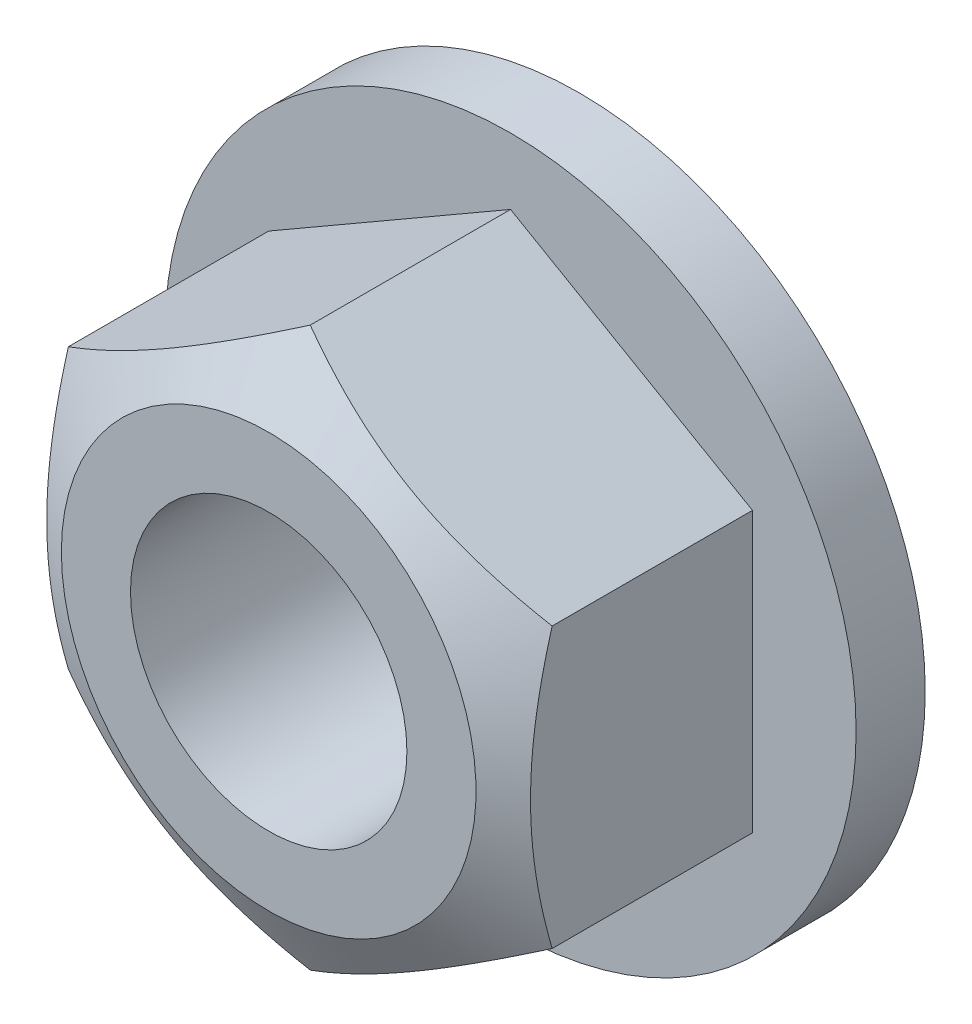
ISO-10303-21;
HEADER;
FILE_DESCRIPTION(('STEP AP214'),'2;1');
FILE_NAME('part.step','',(''),(''),'','','');
FILE_SCHEMA(('AUTOMOTIVE_DESIGN { 1 0 10303 214 1 1 1 1 }'));
ENDSEC;
DATA;
#1=APPLICATION_CONTEXT('core data for automotive mechanical design processes');
#2=APPLICATION_PROTOCOL_DEFINITION('international standard','automotive_design',2000,#1);
#3=PRODUCT_CONTEXT('',#1,'mechanical');
#4=PRODUCT('Part','Part','',(#3));
#5=PRODUCT_RELATED_PRODUCT_CATEGORY('part','',(#4));
#6=PRODUCT_DEFINITION_FORMATION('','',#4);
#7=PRODUCT_DEFINITION_CONTEXT('part definition',#1,'design');
#8=PRODUCT_DEFINITION('design','',#6,#7);
#9=PRODUCT_DEFINITION_SHAPE('','',#8);
#10=(LENGTH_UNIT() NAMED_UNIT(*) SI_UNIT(.MILLI.,.METRE.));
#11=(NAMED_UNIT(*) PLANE_ANGLE_UNIT() SI_UNIT($,.RADIAN.));
#12=(NAMED_UNIT(*) SI_UNIT($,.STERADIAN.) SOLID_ANGLE_UNIT());
#13=UNCERTAINTY_MEASURE_WITH_UNIT(LENGTH_MEASURE(1.E-05),#10,'distance_accuracy_value','');
#14=(GEOMETRIC_REPRESENTATION_CONTEXT(3) GLOBAL_UNCERTAINTY_ASSIGNED_CONTEXT((#13)) GLOBAL_UNIT_ASSIGNED_CONTEXT((#10,
#11,#12)) REPRESENTATION_CONTEXT('',''));
#15=CARTESIAN_POINT('',(0.,0.,0.));
#16=DIRECTION('',(0.,0.,1.));
#17=DIRECTION('',(1.,0.,0.));
#18=AXIS2_PLACEMENT_3D('',#15,#16,#17);
#19=CARTESIAN_POINT('',(0.,4.04145188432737,0.));
#20=DIRECTION('',(0.,0.,1.));
#21=DIRECTION('',(1.,0.,0.));
#22=AXIS2_PLACEMENT_3D('',#19,#20,#21);
#23=PLANE('',#22);
#24=CARTESIAN_POINT('',(0.,0.,0.));
#25=DIRECTION('',(0.,0.,1.));
#26=DIRECTION('',(1.,0.,0.));
#27=AXIS2_PLACEMENT_3D('',#24,#25,#26);
#28=CIRCLE('',#27,5.);
#29=CARTESIAN_POINT('',(5.,0.,0.));
#30=VERTEX_POINT('',#29);
#31=EDGE_CURVE('E93',#30,#30,#28,.T.);
#32=ORIENTED_EDGE('',*,*,#31,.F.);
#33=EDGE_LOOP('',(#32));
#34=FACE_BOUND('',#33,.T.);
#35=CARTESIAN_POINT('',(0.,0.,0.));
#36=DIRECTION('',(0.,0.,1.));
#37=DIRECTION('',(1.,0.,0.));
#38=AXIS2_PLACEMENT_3D('',#35,#36,#37);
#39=CIRCLE('',#38,2.);
#40=CARTESIAN_POINT('',(2.,0.,0.));
#41=VERTEX_POINT('',#40);
#42=EDGE_CURVE('E289',#41,#41,#39,.T.);
#43=ORIENTED_EDGE('',*,*,#42,.T.);
#44=EDGE_LOOP('',(#43));
#45=FACE_BOUND('',#44,.T.);
#46=ADVANCED_FACE('F31',(#34,#45),#23,.F.);
#47=CARTESIAN_POINT('',(0.,4.04145188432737,4.5));
#48=DIRECTION('',(0.,0.,1.));
#49=DIRECTION('',(1.,0.,0.));
#50=AXIS2_PLACEMENT_3D('',#47,#48,#49);
#51=PLANE('',#50);
#52=CARTESIAN_POINT('',(0.,0.,4.5));
#53=DIRECTION('',(0.,0.,-1.));
#54=DIRECTION('',(-1.,0.,0.));
#55=AXIS2_PLACEMENT_3D('',#52,#53,#54);
#56=CIRCLE('',#55,3.);
#57=CARTESIAN_POINT('',(-3.,0.,4.5));
#58=VERTEX_POINT('',#57);
#59=EDGE_CURVE('E90',#58,#58,#56,.T.);
#60=ORIENTED_EDGE('',*,*,#59,.F.);
#61=EDGE_LOOP('',(#60));
#62=FACE_BOUND('',#61,.T.);
#63=CARTESIAN_POINT('',(0.,0.,4.5));
#64=DIRECTION('',(0.,0.,1.));
#65=DIRECTION('',(1.,0.,0.));
#66=AXIS2_PLACEMENT_3D('',#63,#64,#65);
#67=CIRCLE('',#66,2.);
#68=CARTESIAN_POINT('',(2.,0.,4.5));
#69=VERTEX_POINT('',#68);
#70=EDGE_CURVE('E286',#69,#69,#67,.T.);
#71=ORIENTED_EDGE('',*,*,#70,.F.);
#72=EDGE_LOOP('',(#71));
#73=FACE_BOUND('',#72,.T.);
#74=ADVANCED_FACE('F188',(#62,#73),#51,.T.);
#75=CARTESIAN_POINT('',(3.49999999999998,2.02072594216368,4.5));
#76=DIRECTION('',(-0.5,-0.866025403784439,0.));
#77=DIRECTION('',(0.866025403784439,-0.5,0.));
#78=AXIS2_PLACEMENT_3D('',#75,#76,#77);
#79=PLANE('',#78);
#80=CARTESIAN_POINT('',(3.50019999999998,2.02061047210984,3.89865080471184));
#81=CARTESIAN_POINT('',(3.34639282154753,2.10941108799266,3.94993907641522));
#82=CARTESIAN_POINT('',(3.19125798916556,2.19897822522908,3.99658391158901));
#83=CARTESIAN_POINT('',(2.87830199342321,2.37966345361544,4.07800298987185));
#84=CARTESIAN_POINT('',(2.72047526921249,2.47078475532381,4.11274842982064));
#85=CARTESIAN_POINT('',(2.40677778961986,2.65189807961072,4.16683483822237));
#86=CARTESIAN_POINT('',(2.2509553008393,2.74186223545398,4.18653577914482));
#87=CARTESIAN_POINT('',(1.93857711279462,2.92221386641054,4.21005473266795));
#88=CARTESIAN_POINT('',(1.78202254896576,3.01260068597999,4.21389222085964));
#89=CARTESIAN_POINT('',(1.489490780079,3.18149398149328,4.20590956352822));
#90=CARTESIAN_POINT('',(1.35346978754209,3.26002573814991,4.19604943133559));
#91=CARTESIAN_POINT('',(1.082313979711,3.41657761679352,4.1647983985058));
#92=CARTESIAN_POINT('',(0.947180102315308,3.49459719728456,4.1433968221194));
#93=CARTESIAN_POINT('',(0.675465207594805,3.65147186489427,4.08989445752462));
#94=CARTESIAN_POINT('',(0.538918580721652,3.73030709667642,4.05756687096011));
#95=CARTESIAN_POINT('',(0.267861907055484,3.88680174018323,3.98419593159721));
#96=CARTESIAN_POINT('',(0.133348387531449,3.96446315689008,3.94316981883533));
#97=CARTESIAN_POINT('',(-0.000200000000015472,4.04156735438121,3.89865080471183));
#98=B_SPLINE_CURVE_WITH_KNOTS('',3,(#80,#81,#82,#83,#84,#85,#86,#87,#88,#89,#90,#91,#92,#93,#94,
#95,#96,#97),.UNSPECIFIED.,.F.,.F.,(4,2,2,2,2,2,2,2,4),(0.,0.554793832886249,1.11092123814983,
1.65328467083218,2.19498204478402,2.66665130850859,3.13875761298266,3.62133612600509,
4.10296698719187),.UNSPECIFIED.);
#99=CARTESIAN_POINT('',(3.49999999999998,2.02072594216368,3.89871747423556));
#100=VERTEX_POINT('',#99);
#101=CARTESIAN_POINT('',(0.,4.04145188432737,3.89871747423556));
#102=VERTEX_POINT('',#101);
#103=EDGE_CURVE('E86',#100,#102,#98,.T.);
#104=ORIENTED_EDGE('',*,*,#103,.F.);
#105=DIRECTION('',(0.,0.,-1.));
#106=VECTOR('',#105,1.);
#107=CARTESIAN_POINT('',(3.49999999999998,2.02072594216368,4.5));
#108=LINE('',#107,#106);
#109=CARTESIAN_POINT('',(3.49999999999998,2.02072594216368,1.));
#110=VERTEX_POINT('',#109);
#111=EDGE_CURVE('E55',#100,#110,#108,.T.);
#112=ORIENTED_EDGE('',*,*,#111,.T.);
#113=DIRECTION('',(-0.866025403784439,0.5,0.));
#114=VECTOR('',#113,1.);
#115=CARTESIAN_POINT('',(3.49999999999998,2.02072594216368,1.));
#116=LINE('',#115,#114);
#117=CARTESIAN_POINT('',(0.,4.04145188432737,1.));
#118=VERTEX_POINT('',#117);
#119=EDGE_CURVE('E99',#110,#118,#116,.T.);
#120=ORIENTED_EDGE('',*,*,#119,.T.);
#121=DIRECTION('',(0.,0.,-1.));
#122=VECTOR('',#121,1.);
#123=CARTESIAN_POINT('',(0.,4.04145188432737,4.5));
#124=LINE('',#123,#122);
#125=EDGE_CURVE('E40',#102,#118,#124,.T.);
#126=ORIENTED_EDGE('',*,*,#125,.F.);
#127=EDGE_LOOP('',(#104,#112,#120,#126));
#128=FACE_BOUND('',#127,.T.);
#129=ADVANCED_FACE('F33',(#128),#79,.F.);
#130=CARTESIAN_POINT('',(0.,4.04145188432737,4.5));
#131=DIRECTION('',(0.5,-0.866025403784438,0.));
#132=DIRECTION('',(0.866025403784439,0.5,0.));
#133=AXIS2_PLACEMENT_3D('',#130,#131,#132);
#134=PLANE('',#133);
#135=CARTESIAN_POINT('',(0.000199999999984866,4.04156735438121,3.89865080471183));
#136=CARTESIAN_POINT('',(-0.153607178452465,3.95276673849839,3.94993907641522));
#137=CARTESIAN_POINT('',(-0.308742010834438,3.86319960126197,3.996583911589));
#138=CARTESIAN_POINT('',(-0.621698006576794,3.68251437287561,4.07800298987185));
#139=CARTESIAN_POINT('',(-0.779524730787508,3.59139307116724,4.11274842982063));
#140=CARTESIAN_POINT('',(-1.09322221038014,3.41027974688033,4.16683483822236));
#141=CARTESIAN_POINT('',(-1.2490446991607,3.32031559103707,4.18653577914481));
#142=CARTESIAN_POINT('',(-1.56142288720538,3.13996396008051,4.21005473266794));
#143=CARTESIAN_POINT('',(-1.71797745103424,3.04957714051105,4.21389222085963));
#144=CARTESIAN_POINT('',(-2.010509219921,2.88068384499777,4.20590956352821));
#145=CARTESIAN_POINT('',(-2.14653021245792,2.80215208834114,4.19604943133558));
#146=CARTESIAN_POINT('',(-2.417686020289,2.64560020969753,4.16479839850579));
#147=CARTESIAN_POINT('',(-2.55281989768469,2.56758062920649,4.14339682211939));
#148=CARTESIAN_POINT('',(-2.82453479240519,2.41070596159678,4.08989445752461));
#149=CARTESIAN_POINT('',(-2.96108141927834,2.33187072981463,4.0575668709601));
#150=CARTESIAN_POINT('',(-3.23213809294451,2.17537608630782,3.9841959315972));
#151=CARTESIAN_POINT('',(-3.36665161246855,2.09771466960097,3.94316981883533));
#152=CARTESIAN_POINT('',(-3.50020000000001,2.02061047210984,3.89865080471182));
#153=B_SPLINE_CURVE_WITH_KNOTS('',3,(#135,#136,#137,#138,#139,#140,#141,#142,#143,#144,#145,
#146,#147,#148,#149,#150,#151,#152),.UNSPECIFIED.,.F.,.F.,(4,2,2,2,2,2,2,2,4),(0.,
0.554793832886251,1.11092123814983,1.65328467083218,2.19498204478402,2.66665130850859,
3.13875761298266,3.62133612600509,4.10296698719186),.UNSPECIFIED.);
#154=CARTESIAN_POINT('',(-3.50000000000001,2.02072594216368,3.89871747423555));
#155=VERTEX_POINT('',#154);
#156=EDGE_CURVE('E94',#102,#155,#153,.T.);
#157=ORIENTED_EDGE('',*,*,#156,.F.);
#158=ORIENTED_EDGE('',*,*,#125,.T.);
#159=DIRECTION('',(-0.866025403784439,-0.5,0.));
#160=VECTOR('',#159,1.);
#161=CARTESIAN_POINT('',(0.,4.04145188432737,1.));
#162=LINE('',#161,#160);
#163=CARTESIAN_POINT('',(-3.50000000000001,2.02072594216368,1.));
#164=VERTEX_POINT('',#163);
#165=EDGE_CURVE('E103',#118,#164,#162,.T.);
#166=ORIENTED_EDGE('',*,*,#165,.T.);
#167=DIRECTION('',(0.,0.,-1.));
#168=VECTOR('',#167,1.);
#169=CARTESIAN_POINT('',(-3.50000000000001,2.02072594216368,4.5));
#170=LINE('',#169,#168);
#171=EDGE_CURVE('E110',#155,#164,#170,.T.);
#172=ORIENTED_EDGE('',*,*,#171,.F.);
#173=EDGE_LOOP('',(#157,#158,#166,#172));
#174=FACE_BOUND('',#173,.T.);
#175=ADVANCED_FACE('F114',(#174),#134,.F.);
#176=CARTESIAN_POINT('',(-3.50000000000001,2.02072594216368,4.5));
#177=DIRECTION('',(1.,0.,0.));
#178=DIRECTION('',(0.,0.,-1.));
#179=AXIS2_PLACEMENT_3D('',#176,#177,#178);
#180=PLANE('',#179);
#181=CARTESIAN_POINT('',(-3.50000000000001,-5.44413662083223,2.49535781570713));
#182=CARTESIAN_POINT('',(-3.50000000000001,-5.29111744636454,2.56965090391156));
#183=CARTESIAN_POINT('',(-3.50000000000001,-5.13774871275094,2.64323626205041));
#184=CARTESIAN_POINT('',(-3.50000000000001,-4.83012626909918,2.78859375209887));
#185=CARTESIAN_POINT('',(-3.50000000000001,-4.6758724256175,2.86036560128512));
#186=CARTESIAN_POINT('',(-3.50000000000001,-4.36550707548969,3.00205584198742));
#187=CARTESIAN_POINT('',(-3.50000000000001,-4.20939003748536,3.07196215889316));
#188=CARTESIAN_POINT('',(-3.50000000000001,-3.89591975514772,3.20893514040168));
#189=CARTESIAN_POINT('',(-3.50000000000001,-3.73856656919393,3.27600193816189));
#190=CARTESIAN_POINT('',(-3.50000000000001,-3.41726237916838,3.40865695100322));
#191=CARTESIAN_POINT('',(-3.50000000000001,-3.25326247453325,3.47412736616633));
#192=CARTESIAN_POINT('',(-3.50000000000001,-2.92335003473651,3.60015229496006));
#193=CARTESIAN_POINT('',(-3.50000000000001,-2.75743728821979,3.66070625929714));
#194=CARTESIAN_POINT('',(-3.50000000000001,-2.42374043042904,3.7753207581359));
#195=CARTESIAN_POINT('',(-3.50000000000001,-2.2559608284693,3.82939429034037));
#196=CARTESIAN_POINT('',(-3.50000000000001,-1.91799502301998,3.92932361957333));
#197=CARTESIAN_POINT('',(-3.50000000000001,-1.74780959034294,3.97518198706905));
#198=CARTESIAN_POINT('',(-3.50000000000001,-1.40586794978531,4.05624996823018));
#199=CARTESIAN_POINT('',(-3.50000000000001,-1.2341256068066,4.09151699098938));
#200=CARTESIAN_POINT('',(-3.50000000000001,-0.888488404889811,4.14941479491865));
#201=CARTESIAN_POINT('',(-3.50000000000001,-0.714593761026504,4.17204682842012));
#202=CARTESIAN_POINT('',(-3.50000000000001,-0.367799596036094,4.20257359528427));
#203=CARTESIAN_POINT('',(-3.50000000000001,-0.194917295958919,4.21065914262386));
#204=CARTESIAN_POINT('',(-3.50000000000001,0.150916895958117,4.21191074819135));
#205=CARTESIAN_POINT('',(-3.50000000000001,0.32386878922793,4.20507648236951));
#206=CARTESIAN_POINT('',(-3.50000000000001,0.616981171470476,4.18133576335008));
#207=CARTESIAN_POINT('',(-3.50000000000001,0.73745351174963,4.16805487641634));
#208=CARTESIAN_POINT('',(-3.50000000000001,0.977521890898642,4.13507166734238));
#209=CARTESIAN_POINT('',(-3.50000000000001,1.09711781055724,4.11536848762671));
#210=CARTESIAN_POINT('',(-3.50000000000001,1.45442644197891,4.04766052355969));
#211=CARTESIAN_POINT('',(-3.50000000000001,1.69053049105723,3.99106920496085));
#212=CARTESIAN_POINT('',(-3.50000000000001,2.04364694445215,3.89285434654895));
#213=CARTESIAN_POINT('',(-3.50000000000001,2.16248667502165,3.85742605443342));
#214=CARTESIAN_POINT('',(-3.50000000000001,2.39901154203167,3.78287118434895));
#215=CARTESIAN_POINT('',(-3.50000000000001,2.5166966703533,3.74374458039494));
#216=CARTESIAN_POINT('',(-3.50000000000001,2.75094998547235,3.66242263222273));
#217=CARTESIAN_POINT('',(-3.50000000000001,2.86751851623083,3.62022826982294));
#218=CARTESIAN_POINT('',(-3.50000000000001,3.0996877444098,3.53326915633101));
#219=CARTESIAN_POINT('',(-3.50000000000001,3.21528845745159,3.48850444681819));
#220=CARTESIAN_POINT('',(-3.50000000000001,3.50479789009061,3.37328511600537));
#221=CARTESIAN_POINT('',(-3.50000000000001,3.67815487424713,3.3014460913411));
#222=CARTESIAN_POINT('',(-3.50000000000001,4.0232638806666,3.15399924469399));
#223=CARTESIAN_POINT('',(-3.50000000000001,4.19501577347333,3.07839112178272));
#224=CARTESIAN_POINT('',(-3.50000000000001,4.53724111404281,2.92422690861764));
#225=CARTESIAN_POINT('',(-3.50000000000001,4.70771421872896,2.84567005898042));
#226=CARTESIAN_POINT('',(-3.50000000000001,5.04757713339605,2.68624312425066));
#227=CARTESIAN_POINT('',(-3.50000000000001,5.21696691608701,2.60537298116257));
#228=CARTESIAN_POINT('',(-3.50000000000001,5.7242356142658,2.35981375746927));
#229=CARTESIAN_POINT('',(-3.50000000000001,6.06078159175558,2.19237371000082));
#230=CARTESIAN_POINT('',(-3.50000000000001,6.73137193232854,1.85271783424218));
#231=CARTESIAN_POINT('',(-3.50000000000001,7.06541667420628,1.68050274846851));
#232=CARTESIAN_POINT('',(-3.50000000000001,7.70065950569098,1.34896726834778));
#233=CARTESIAN_POINT('',(-3.50000000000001,8.00201288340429,1.18994387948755));
#234=CARTESIAN_POINT('',(-3.50000000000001,8.60365256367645,0.869861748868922));
#235=CARTESIAN_POINT('',(-3.50000000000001,8.90393881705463,0.708802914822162));
#236=CARTESIAN_POINT('',(-3.50000000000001,9.50283317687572,0.385613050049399));
#237=CARTESIAN_POINT('',(-3.50000000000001,9.8014436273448,0.223486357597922));
#238=CARTESIAN_POINT('',(-3.50000000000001,10.397991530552,-0.101955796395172));
#239=CARTESIAN_POINT('',(-3.50000000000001,10.6959290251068,-0.265271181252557));
#240=CARTESIAN_POINT('',(-3.50000000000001,10.9936239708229,-0.429024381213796));
#241=B_SPLINE_CURVE_WITH_KNOTS('',3,(#181,#182,#183,#184,#185,#186,#187,#188,#189,#190,#191,
#192,#193,#194,#195,#196,#197,#198,#199,#200,#201,#202,#203,#204,#205,#206,#207,#208,#209,#210,
#211,#212,#213,#214,#215,#216,#217,#218,#219,#220,#221,#222,#223,#224,#225,#226,#227,#228,#229,
#230,#231,#232,#233,#234,#235,#236,#237,#238,#239,#240),.UNSPECIFIED.,.F.,.F.,(4,2,2,2,2,2,2,2,
2,2,2,2,2,2,2,2,2,2,2,2,2,2,2,2,2,2,2,2,2,4),(0.,0.510308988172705,1.02069704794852,
1.53383597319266,2.04695080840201,2.5766455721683,3.10639943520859,3.63507233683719,
4.1635795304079,4.68916804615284,5.21470445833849,5.73329542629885,6.25189765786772,
6.61532824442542,6.97880738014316,7.70615411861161,8.07814699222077,8.45014247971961,
8.82201943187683,9.19389037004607,9.75678497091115,10.3197245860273,10.882810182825,
11.4459099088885,12.5735352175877,13.7009861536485,14.7231892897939,15.7454389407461,
16.764788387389,17.7840726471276),.UNSPECIFIED.);
#242=CARTESIAN_POINT('',(-3.50000000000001,-2.0207259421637,3.89871747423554));
#243=VERTEX_POINT('',#242);
#244=EDGE_CURVE('E172',#155,#243,#241,.F.);
#245=ORIENTED_EDGE('',*,*,#244,.F.);
#246=ORIENTED_EDGE('',*,*,#171,.T.);
#247=DIRECTION('',(0.,-1.,0.));
#248=VECTOR('',#247,1.);
#249=CARTESIAN_POINT('',(-3.50000000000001,2.02072594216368,1.));
#250=LINE('',#249,#248);
#251=CARTESIAN_POINT('',(-3.50000000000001,-2.0207259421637,1.));
#252=VERTEX_POINT('',#251);
#253=EDGE_CURVE('E121',#164,#252,#250,.T.);
#254=ORIENTED_EDGE('',*,*,#253,.T.);
#255=DIRECTION('',(0.,0.,-1.));
#256=VECTOR('',#255,1.);
#257=CARTESIAN_POINT('',(-3.50000000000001,-2.0207259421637,4.5));
#258=LINE('',#257,#256);
#259=EDGE_CURVE('E108',#243,#252,#258,.T.);
#260=ORIENTED_EDGE('',*,*,#259,.F.);
#261=EDGE_LOOP('',(#245,#246,#254,#260));
#262=FACE_BOUND('',#261,.T.);
#263=ADVANCED_FACE('F177',(#262),#180,.F.);
#264=CARTESIAN_POINT('',(-3.50000000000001,-2.0207259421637,4.5));
#265=DIRECTION('',(0.499999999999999,0.866025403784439,0.));
#266=DIRECTION('',(-0.866025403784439,0.5,0.));
#267=AXIS2_PLACEMENT_3D('',#264,#265,#266);
#268=PLANE('',#267);
#269=CARTESIAN_POINT('',(-3.50020000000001,-2.02061047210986,3.89865080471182));
#270=CARTESIAN_POINT('',(-3.34639282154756,-2.10941108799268,3.9499390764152));
#271=CARTESIAN_POINT('',(-3.19125798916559,-2.1989782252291,3.99658391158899));
#272=CARTESIAN_POINT('',(-2.87830199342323,-2.37966345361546,4.07800298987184));
#273=CARTESIAN_POINT('',(-2.72047526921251,-2.47078475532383,4.11274842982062));
#274=CARTESIAN_POINT('',(-2.40677778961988,-2.65189807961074,4.16683483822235));
#275=CARTESIAN_POINT('',(-2.25095530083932,-2.741862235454,4.1865357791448));
#276=CARTESIAN_POINT('',(-1.93857711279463,-2.92221386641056,4.21005473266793));
#277=CARTESIAN_POINT('',(-1.78202254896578,-3.01260068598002,4.21389222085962));
#278=CARTESIAN_POINT('',(-1.48949078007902,-3.18149398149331,4.20590956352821));
#279=CARTESIAN_POINT('',(-1.3534697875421,-3.26002573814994,4.19604943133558));
#280=CARTESIAN_POINT('',(-1.08231397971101,-3.41657761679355,4.16479839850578));
#281=CARTESIAN_POINT('',(-0.947180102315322,-3.49459719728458,4.14339682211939));
#282=CARTESIAN_POINT('',(-0.67546520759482,-3.6514718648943,4.08989445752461));
#283=CARTESIAN_POINT('',(-0.538918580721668,-3.73030709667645,4.0575668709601));
#284=CARTESIAN_POINT('',(-0.267861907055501,-3.88680174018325,3.98419593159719));
#285=CARTESIAN_POINT('',(-0.133348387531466,-3.9644631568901,3.94316981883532));
#286=CARTESIAN_POINT('',(0.000199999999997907,-4.04156735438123,3.89865080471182));
#287=B_SPLINE_CURVE_WITH_KNOTS('',3,(#269,#270,#271,#272,#273,#274,#275,#276,#277,#278,#279,
#280,#281,#282,#283,#284,#285,#286),.UNSPECIFIED.,.F.,.F.,(4,2,2,2,2,2,2,2,4),(0.,
0.554793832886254,1.11092123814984,1.65328467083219,2.19498204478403,2.6666513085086,
3.13875761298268,3.6213361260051,4.10296698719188),.UNSPECIFIED.);
#288=CARTESIAN_POINT('',(0.,-4.04145188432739,3.89871747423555));
#289=VERTEX_POINT('',#288);
#290=EDGE_CURVE('E167',#243,#289,#287,.T.);
#291=ORIENTED_EDGE('',*,*,#290,.F.);
#292=ORIENTED_EDGE('',*,*,#259,.T.);
#293=DIRECTION('',(0.866025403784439,-0.5,0.));
#294=VECTOR('',#293,1.);
#295=CARTESIAN_POINT('',(-3.50000000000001,-2.0207259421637,1.));
#296=LINE('',#295,#294);
#297=CARTESIAN_POINT('',(0.,-4.04145188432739,1.));
#298=VERTEX_POINT('',#297);
#299=EDGE_CURVE('E122',#252,#298,#296,.T.);
#300=ORIENTED_EDGE('',*,*,#299,.T.);
#301=DIRECTION('',(0.,0.,-1.));
#302=VECTOR('',#301,1.);
#303=CARTESIAN_POINT('',(0.,-4.04145188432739,4.5));
#304=LINE('',#303,#302);
#305=EDGE_CURVE('E101',#289,#298,#304,.T.);
#306=ORIENTED_EDGE('',*,*,#305,.F.);
#307=EDGE_LOOP('',(#291,#292,#300,#306));
#308=FACE_BOUND('',#307,.T.);
#309=ADVANCED_FACE('F180',(#308),#268,.F.);
#310=CARTESIAN_POINT('',(0.,-4.04145188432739,4.5));
#311=DIRECTION('',(-0.5,0.866025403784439,0.));
#312=DIRECTION('',(-0.866025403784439,-0.5,0.));
#313=AXIS2_PLACEMENT_3D('',#310,#311,#312);
#314=PLANE('',#313);
#315=CARTESIAN_POINT('',(-0.000200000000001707,-4.04156735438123,3.89865080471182));
#316=CARTESIAN_POINT('',(0.153607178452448,-3.95276673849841,3.94993907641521));
#317=CARTESIAN_POINT('',(0.308742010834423,-3.86319960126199,3.99658391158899));
#318=CARTESIAN_POINT('',(0.62169800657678,-3.68251437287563,4.07800298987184));
#319=CARTESIAN_POINT('',(0.779524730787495,-3.59139307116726,4.11274842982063));
#320=CARTESIAN_POINT('',(1.09322221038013,-3.41027974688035,4.16683483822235));
#321=CARTESIAN_POINT('',(1.24904469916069,-3.32031559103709,4.1865357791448));
#322=CARTESIAN_POINT('',(1.56142288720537,-3.13996396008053,4.21005473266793));
#323=CARTESIAN_POINT('',(1.71797745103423,-3.04957714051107,4.21389222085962));
#324=CARTESIAN_POINT('',(2.01050921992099,-2.88068384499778,4.20590956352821));
#325=CARTESIAN_POINT('',(2.1465302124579,-2.80215208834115,4.19604943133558));
#326=CARTESIAN_POINT('',(2.41768602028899,-2.64560020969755,4.16479839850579));
#327=CARTESIAN_POINT('',(2.55281989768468,-2.56758062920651,4.14339682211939));
#328=CARTESIAN_POINT('',(2.82453479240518,-2.4107059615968,4.08989445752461));
#329=CARTESIAN_POINT('',(2.96108141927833,-2.33187072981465,4.0575668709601));
#330=CARTESIAN_POINT('',(3.23213809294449,-2.17537608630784,3.9841959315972));
#331=CARTESIAN_POINT('',(3.36665161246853,-2.097714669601,3.94316981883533));
#332=CARTESIAN_POINT('',(3.50019999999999,-2.02061047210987,3.89865080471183));
#333=B_SPLINE_CURVE_WITH_KNOTS('',3,(#315,#316,#317,#318,#319,#320,#321,#322,#323,#324,#325,
#326,#327,#328,#329,#330,#331,#332),.UNSPECIFIED.,.F.,.F.,(4,2,2,2,2,2,2,2,4),(0.,
0.554793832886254,1.11092123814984,1.65328467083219,2.19498204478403,2.6666513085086,
3.13875761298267,3.62133612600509,4.10296698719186),.UNSPECIFIED.);
#334=CARTESIAN_POINT('',(3.49999999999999,-2.02072594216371,3.89871747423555));
#335=VERTEX_POINT('',#334);
#336=EDGE_CURVE('E47',#289,#335,#333,.T.);
#337=ORIENTED_EDGE('',*,*,#336,.F.);
#338=ORIENTED_EDGE('',*,*,#305,.T.);
#339=DIRECTION('',(0.866025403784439,0.5,0.));
#340=VECTOR('',#339,1.);
#341=CARTESIAN_POINT('',(0.,-4.04145188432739,1.));
#342=LINE('',#341,#340);
#343=CARTESIAN_POINT('',(3.49999999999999,-2.02072594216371,1.));
#344=VERTEX_POINT('',#343);
#345=EDGE_CURVE('E127',#298,#344,#342,.T.);
#346=ORIENTED_EDGE('',*,*,#345,.T.);
#347=DIRECTION('',(0.,0.,-1.));
#348=VECTOR('',#347,1.);
#349=CARTESIAN_POINT('',(3.49999999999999,-2.02072594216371,4.5));
#350=LINE('',#349,#348);
#351=EDGE_CURVE('E98',#335,#344,#350,.T.);
#352=ORIENTED_EDGE('',*,*,#351,.F.);
#353=EDGE_LOOP('',(#337,#338,#346,#352));
#354=FACE_BOUND('',#353,.T.);
#355=ADVANCED_FACE('F201',(#354),#314,.F.);
#356=CARTESIAN_POINT('',(3.49999999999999,-2.02072594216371,4.5));
#357=DIRECTION('',(-1.,0.,0.));
#358=DIRECTION('',(0.,-1.,0.));
#359=AXIS2_PLACEMENT_3D('',#356,#357,#358);
#360=PLANE('',#359);
#361=CARTESIAN_POINT('',(3.5,-5.44413662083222,2.49535781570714));
#362=CARTESIAN_POINT('',(3.49999999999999,-5.29111744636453,2.56965090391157));
#363=CARTESIAN_POINT('',(3.49999999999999,-5.13774871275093,2.64323626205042));
#364=CARTESIAN_POINT('',(3.49999999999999,-4.83012626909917,2.78859375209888));
#365=CARTESIAN_POINT('',(3.49999999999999,-4.67587242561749,2.86036560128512));
#366=CARTESIAN_POINT('',(3.49999999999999,-4.36550707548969,3.00205584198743));
#367=CARTESIAN_POINT('',(3.49999999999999,-4.20939003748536,3.07196215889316));
#368=CARTESIAN_POINT('',(3.49999999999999,-3.89591975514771,3.20893514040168));
#369=CARTESIAN_POINT('',(3.49999999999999,-3.73856656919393,3.2760019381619));
#370=CARTESIAN_POINT('',(3.49999999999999,-3.41726237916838,3.40865695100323));
#371=CARTESIAN_POINT('',(3.49999999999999,-3.25326247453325,3.47412736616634));
#372=CARTESIAN_POINT('',(3.49999999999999,-2.92335003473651,3.60015229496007));
#373=CARTESIAN_POINT('',(3.49999999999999,-2.7574372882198,3.66070625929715));
#374=CARTESIAN_POINT('',(3.49999999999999,-2.42374043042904,3.77532075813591));
#375=CARTESIAN_POINT('',(3.49999999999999,-2.25596082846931,3.82939429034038));
#376=CARTESIAN_POINT('',(3.49999999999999,-1.91799502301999,3.92932361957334));
#377=CARTESIAN_POINT('',(3.49999999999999,-1.74780959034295,3.97518198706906));
#378=CARTESIAN_POINT('',(3.49999999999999,-1.40586794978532,4.05624996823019));
#379=CARTESIAN_POINT('',(3.49999999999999,-1.23412560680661,4.09151699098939));
#380=CARTESIAN_POINT('',(3.49999999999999,-0.888488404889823,4.14941479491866));
#381=CARTESIAN_POINT('',(3.49999999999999,-0.714593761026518,4.17204682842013));
#382=CARTESIAN_POINT('',(3.49999999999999,-0.367799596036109,4.20257359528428));
#383=CARTESIAN_POINT('',(3.49999999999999,-0.194917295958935,4.21065914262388));
#384=CARTESIAN_POINT('',(3.49999999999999,0.1509168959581,4.21191074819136));
#385=CARTESIAN_POINT('',(3.49999999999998,0.323868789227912,4.20507648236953));
#386=CARTESIAN_POINT('',(3.49999999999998,0.616981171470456,4.1813357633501));
#387=CARTESIAN_POINT('',(3.49999999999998,0.737453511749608,4.16805487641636));
#388=CARTESIAN_POINT('',(3.49999999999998,0.977521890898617,4.1350716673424));
#389=CARTESIAN_POINT('',(3.49999999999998,1.09711781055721,4.11536848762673));
#390=CARTESIAN_POINT('',(3.49999999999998,1.45442644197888,4.04766052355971));
#391=CARTESIAN_POINT('',(3.49999999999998,1.6905304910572,3.99106920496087));
#392=CARTESIAN_POINT('',(3.49999999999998,2.04364694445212,3.89285434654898));
#393=CARTESIAN_POINT('',(3.49999999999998,2.16248667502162,3.85742605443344));
#394=CARTESIAN_POINT('',(3.49999999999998,2.39901154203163,3.78287118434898));
#395=CARTESIAN_POINT('',(3.49999999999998,2.51669667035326,3.74374458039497));
#396=CARTESIAN_POINT('',(3.49999999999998,2.7509499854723,3.66242263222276));
#397=CARTESIAN_POINT('',(3.49999999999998,2.86751851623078,3.62022826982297));
#398=CARTESIAN_POINT('',(3.49999999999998,3.09968774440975,3.53326915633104));
#399=CARTESIAN_POINT('',(3.49999999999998,3.21528845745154,3.48850444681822));
#400=CARTESIAN_POINT('',(3.49999999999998,3.50479789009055,3.3732851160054));
#401=CARTESIAN_POINT('',(3.49999999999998,3.67815487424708,3.30144609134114));
#402=CARTESIAN_POINT('',(3.49999999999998,4.02326388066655,3.15399924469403));
#403=CARTESIAN_POINT('',(3.49999999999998,4.19501577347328,3.07839112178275));
#404=CARTESIAN_POINT('',(3.49999999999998,4.53724111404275,2.92422690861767));
#405=CARTESIAN_POINT('',(3.49999999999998,4.70771421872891,2.84567005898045));
#406=CARTESIAN_POINT('',(3.49999999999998,5.047577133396,2.6862431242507));
#407=CARTESIAN_POINT('',(3.49999999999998,5.21696691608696,2.6053729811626));
#408=CARTESIAN_POINT('',(3.49999999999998,5.72423561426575,2.3598137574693));
#409=CARTESIAN_POINT('',(3.49999999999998,6.06078159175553,2.19237371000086));
#410=CARTESIAN_POINT('',(3.49999999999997,6.73137193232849,1.85271783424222));
#411=CARTESIAN_POINT('',(3.49999999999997,7.06541667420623,1.68050274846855));
#412=CARTESIAN_POINT('',(3.49999999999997,7.70065950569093,1.34896726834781));
#413=CARTESIAN_POINT('',(3.49999999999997,8.00201288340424,1.18994387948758));
#414=CARTESIAN_POINT('',(3.49999999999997,8.60365256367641,0.869861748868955));
#415=CARTESIAN_POINT('',(3.49999999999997,8.90393881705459,0.708802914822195));
#416=CARTESIAN_POINT('',(3.49999999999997,9.50283317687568,0.38561305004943));
#417=CARTESIAN_POINT('',(3.49999999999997,9.80144362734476,0.223486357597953));
#418=CARTESIAN_POINT('',(3.49999999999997,10.397991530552,-0.101955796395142));
#419=CARTESIAN_POINT('',(3.49999999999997,10.6959290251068,-0.265271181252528));
#420=CARTESIAN_POINT('',(3.49999999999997,10.9936239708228,-0.429024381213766));
#421=B_SPLINE_CURVE_WITH_KNOTS('',3,(#361,#362,#363,#364,#365,#366,#367,#368,#369,#370,#371,
#372,#373,#374,#375,#376,#377,#378,#379,#380,#381,#382,#383,#384,#385,#386,#387,#388,#389,#390,
#391,#392,#393,#394,#395,#396,#397,#398,#399,#400,#401,#402,#403,#404,#405,#406,#407,#408,#409,
#410,#411,#412,#413,#414,#415,#416,#417,#418,#419,#420),.UNSPECIFIED.,.F.,.F.,(4,2,2,2,2,2,2,2,
2,2,2,2,2,2,2,2,2,2,2,2,2,2,2,2,2,2,2,2,2,4),(0.,0.510308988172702,1.02069704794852,
1.53383597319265,2.046950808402,2.57664557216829,3.10639943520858,3.63507233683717,
4.16357953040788,4.68916804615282,5.21470445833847,5.73329542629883,6.2518976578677,
6.61532824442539,6.97880738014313,7.70615411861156,8.07814699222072,8.45014247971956,
8.82201943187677,9.193890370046,9.75678497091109,10.3197245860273,10.882810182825,
11.4459099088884,12.5735352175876,13.7009861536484,14.7231892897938,15.7454389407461,
16.764788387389,17.7840726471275),.UNSPECIFIED.);
#422=EDGE_CURVE('E84',#335,#100,#421,.T.);
#423=ORIENTED_EDGE('',*,*,#422,.F.);
#424=ORIENTED_EDGE('',*,*,#351,.T.);
#425=DIRECTION('',(0.,1.,0.));
#426=VECTOR('',#425,1.);
#427=CARTESIAN_POINT('',(3.49999999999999,-2.02072594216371,1.));
#428=LINE('',#427,#426);
#429=EDGE_CURVE('E11',#344,#110,#428,.T.);
#430=ORIENTED_EDGE('',*,*,#429,.T.);
#431=ORIENTED_EDGE('',*,*,#111,.F.);
#432=EDGE_LOOP('',(#423,#424,#430,#431));
#433=FACE_BOUND('',#432,.T.);
#434=ADVANCED_FACE('F96',(#433),#360,.F.);
#435=CARTESIAN_POINT('',(0.,0.,1.));
#436=DIRECTION('',(0.,0.,1.));
#437=DIRECTION('',(1.,0.,0.));
#438=AXIS2_PLACEMENT_3D('',#435,#436,#437);
#439=PLANE('',#438);
#440=CARTESIAN_POINT('',(0.,0.,1.));
#441=DIRECTION('',(0.,0.,1.));
#442=DIRECTION('',(1.,0.,0.));
#443=AXIS2_PLACEMENT_3D('',#440,#441,#442);
#444=CIRCLE('',#443,5.);
#445=CARTESIAN_POINT('',(5.,0.,1.));
#446=VERTEX_POINT('',#445);
#447=EDGE_CURVE('E130',#446,#446,#444,.T.);
#448=ORIENTED_EDGE('',*,*,#447,.T.);
#449=EDGE_LOOP('',(#448));
#450=FACE_BOUND('',#449,.T.);
#451=ORIENTED_EDGE('',*,*,#119,.F.);
#452=ORIENTED_EDGE('',*,*,#429,.F.);
#453=ORIENTED_EDGE('',*,*,#345,.F.);
#454=ORIENTED_EDGE('',*,*,#299,.F.);
#455=ORIENTED_EDGE('',*,*,#253,.F.);
#456=ORIENTED_EDGE('',*,*,#165,.F.);
#457=EDGE_LOOP('',(#451,#452,#453,#454,#455,#456));
#458=FACE_BOUND('',#457,.T.);
#459=ADVANCED_FACE('F118',(#450,#458),#439,.T.);
#460=CARTESIAN_POINT('',(0.,0.,1.));
#461=DIRECTION('',(0.,0.,-1.));
#462=DIRECTION('',(-1.,0.,0.));
#463=AXIS2_PLACEMENT_3D('',#460,#461,#462);
#464=CYLINDRICAL_SURFACE('',#463,5.);
#465=ORIENTED_EDGE('',*,*,#447,.F.);
#466=EDGE_LOOP('',(#465));
#467=FACE_BOUND('',#466,.T.);
#468=ORIENTED_EDGE('',*,*,#31,.T.);
#469=EDGE_LOOP('',(#468));
#470=FACE_BOUND('',#469,.T.);
#471=ADVANCED_FACE('F148',(#467,#470),#464,.T.);
#472=CARTESIAN_POINT('',(0.,0.,3.00145481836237));
#473=DIRECTION('',(0.,0.,-1.));
#474=DIRECTION('',(-1.,0.,0.));
#475=AXIS2_PLACEMENT_3D('',#472,#473,#474);
#476=CONICAL_SURFACE('',#475,5.59555639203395,1.0471975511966);
#477=ORIENTED_EDGE('',*,*,#59,.T.);
#478=EDGE_LOOP('',(#477));
#479=FACE_BOUND('',#478,.T.);
#480=ORIENTED_EDGE('',*,*,#103,.T.);
#481=ORIENTED_EDGE('',*,*,#156,.T.);
#482=ORIENTED_EDGE('',*,*,#244,.T.);
#483=ORIENTED_EDGE('',*,*,#290,.T.);
#484=ORIENTED_EDGE('',*,*,#336,.T.);
#485=ORIENTED_EDGE('',*,*,#422,.T.);
#486=EDGE_LOOP('',(#480,#481,#482,#483,#484,#485));
#487=FACE_BOUND('',#486,.T.);
#488=ADVANCED_FACE('F85',(#479,#487),#476,.T.);
#489=CARTESIAN_POINT('',(0.,0.,4.5));
#490=DIRECTION('',(0.,0.,-1.));
#491=DIRECTION('',(-1.,0.,0.));
#492=AXIS2_PLACEMENT_3D('',#489,#490,#491);
#493=CYLINDRICAL_SURFACE('',#492,2.);
#494=ORIENTED_EDGE('',*,*,#70,.T.);
#495=EDGE_LOOP('',(#494));
#496=FACE_BOUND('',#495,.T.);
#497=ORIENTED_EDGE('',*,*,#42,.F.);
#498=EDGE_LOOP('',(#497));
#499=FACE_BOUND('',#498,.T.);
#500=ADVANCED_FACE('F147',(#496,#499),#493,.F.);
#501=CLOSED_SHELL('',(#46,#74,#129,#175,#263,#309,#355,#434,#459,#471,#488,#500));
#502=MANIFOLD_SOLID_BREP('B2',#501);
#503=ADVANCED_BREP_SHAPE_REPRESENTATION('',(#18,#502),#14);
#504=SHAPE_DEFINITION_REPRESENTATION(#9,#503);
ENDSEC;
END-ISO-10303-21;
